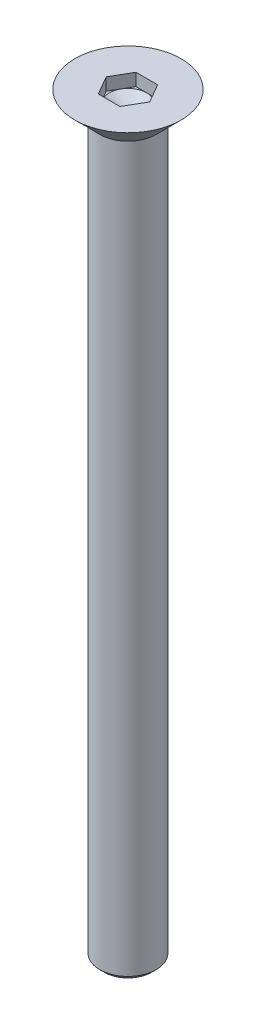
ISO-10303-21;
HEADER;
FILE_DESCRIPTION(('STEP AP214'),'2;1');
FILE_NAME('part.step','',(''),(''),'','','');
FILE_SCHEMA(('AUTOMOTIVE_DESIGN { 1 0 10303 214 1 1 1 1 }'));
ENDSEC;
DATA;
#1=APPLICATION_CONTEXT('core data for automotive mechanical design processes');
#2=APPLICATION_PROTOCOL_DEFINITION('international standard','automotive_design',2000,#1);
#3=PRODUCT_CONTEXT('',#1,'mechanical');
#4=PRODUCT('Part','Part','',(#3));
#5=PRODUCT_RELATED_PRODUCT_CATEGORY('part','',(#4));
#6=PRODUCT_DEFINITION_FORMATION('','',#4);
#7=PRODUCT_DEFINITION_CONTEXT('part definition',#1,'design');
#8=PRODUCT_DEFINITION('design','',#6,#7);
#9=PRODUCT_DEFINITION_SHAPE('','',#8);
#10=(LENGTH_UNIT() NAMED_UNIT(*) SI_UNIT(.MILLI.,.METRE.));
#11=(NAMED_UNIT(*) PLANE_ANGLE_UNIT() SI_UNIT($,.RADIAN.));
#12=(NAMED_UNIT(*) SI_UNIT($,.STERADIAN.) SOLID_ANGLE_UNIT());
#13=UNCERTAINTY_MEASURE_WITH_UNIT(LENGTH_MEASURE(1.E-05),#10,'distance_accuracy_value','');
#14=(GEOMETRIC_REPRESENTATION_CONTEXT(3) GLOBAL_UNCERTAINTY_ASSIGNED_CONTEXT((#13)) GLOBAL_UNIT_ASSIGNED_CONTEXT((#10,
#11,#12)) REPRESENTATION_CONTEXT('',''));
#15=CARTESIAN_POINT('',(0.,0.,0.));
#16=DIRECTION('',(0.,0.,1.));
#17=DIRECTION('',(1.,0.,0.));
#18=AXIS2_PLACEMENT_3D('',#15,#16,#17);
#19=CARTESIAN_POINT('',(0.,0.,0.));
#20=DIRECTION('',(0.,1.,0.));
#21=DIRECTION('',(0.,0.,1.));
#22=AXIS2_PLACEMENT_3D('',#19,#20,#21);
#23=PLANE('',#22);
#24=DIRECTION('',(-0.500000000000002,0.,0.866025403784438));
#25=VECTOR('',#24,1.);
#26=CARTESIAN_POINT('',(-1.15470053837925,0.,-2.));
#27=LINE('',#26,#25);
#28=CARTESIAN_POINT('',(-1.15470053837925,0.,-2.));
#29=VERTEX_POINT('',#28);
#30=CARTESIAN_POINT('',(-2.30940107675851,0.,0.));
#31=VERTEX_POINT('',#30);
#32=EDGE_CURVE('E156',#29,#31,#27,.T.);
#33=ORIENTED_EDGE('',*,*,#32,.F.);
#34=DIRECTION('',(-1.,0.,0.));
#35=VECTOR('',#34,1.);
#36=CARTESIAN_POINT('',(1.15470053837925,0.,-2.));
#37=LINE('',#36,#35);
#38=CARTESIAN_POINT('',(1.15470053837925,0.,-2.));
#39=VERTEX_POINT('',#38);
#40=EDGE_CURVE('E154',#39,#29,#37,.T.);
#41=ORIENTED_EDGE('',*,*,#40,.F.);
#42=DIRECTION('',(-0.500000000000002,0.,-0.866025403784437));
#43=VECTOR('',#42,1.);
#44=CARTESIAN_POINT('',(1.15470053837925,0.,-2.));
#45=LINE('',#44,#43);
#46=CARTESIAN_POINT('',(2.30940107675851,0.,0.));
#47=VERTEX_POINT('',#46);
#48=EDGE_CURVE('E152',#47,#39,#45,.T.);
#49=ORIENTED_EDGE('',*,*,#48,.F.);
#50=DIRECTION('',(0.500000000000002,0.,-0.866025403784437));
#51=VECTOR('',#50,1.);
#52=CARTESIAN_POINT('',(1.15470053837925,0.,2.));
#53=LINE('',#52,#51);
#54=CARTESIAN_POINT('',(1.15470053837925,0.,2.));
#55=VERTEX_POINT('',#54);
#56=EDGE_CURVE('E150',#55,#47,#53,.T.);
#57=ORIENTED_EDGE('',*,*,#56,.F.);
#58=DIRECTION('',(1.,0.,0.));
#59=VECTOR('',#58,1.);
#60=CARTESIAN_POINT('',(1.15470053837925,0.,2.));
#61=LINE('',#60,#59);
#62=CARTESIAN_POINT('',(-1.15470053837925,0.,2.));
#63=VERTEX_POINT('',#62);
#64=EDGE_CURVE('E122',#63,#55,#61,.T.);
#65=ORIENTED_EDGE('',*,*,#64,.F.);
#66=DIRECTION('',(0.500000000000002,0.,0.866025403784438));
#67=VECTOR('',#66,1.);
#68=CARTESIAN_POINT('',(-1.15470053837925,0.,2.));
#69=LINE('',#68,#67);
#70=EDGE_CURVE('E116',#31,#63,#69,.T.);
#71=ORIENTED_EDGE('',*,*,#70,.F.);
#72=EDGE_LOOP('',(#33,#41,#49,#57,#65,#71));
#73=FACE_BOUND('',#72,.T.);
#74=CARTESIAN_POINT('',(0.,0.,0.));
#75=DIRECTION('',(0.,1.,0.));
#76=DIRECTION('',(-1.,0.,0.));
#77=AXIS2_PLACEMENT_3D('',#74,#75,#76);
#78=CIRCLE('',#77,5.65);
#79=CARTESIAN_POINT('',(-5.65,0.,0.));
#80=VERTEX_POINT('',#79);
#81=EDGE_CURVE('E179',#80,#80,#78,.T.);
#82=ORIENTED_EDGE('',*,*,#81,.T.);
#83=EDGE_LOOP('',(#82));
#84=FACE_BOUND('',#83,.T.);
#85=ADVANCED_FACE('F36',(#73,#84),#23,.T.);
#86=CARTESIAN_POINT('',(0.,-80.,0.));
#87=DIRECTION('',(0.,1.,0.));
#88=DIRECTION('',(0.,0.,1.));
#89=AXIS2_PLACEMENT_3D('',#86,#87,#88);
#90=CYLINDRICAL_SURFACE('',#89,3.);
#91=CARTESIAN_POINT('',(0.,-79.5,0.));
#92=DIRECTION('',(0.,1.,0.));
#93=DIRECTION('',(0.,0.,1.));
#94=AXIS2_PLACEMENT_3D('',#91,#92,#93);
#95=CIRCLE('',#94,3.);
#96=CARTESIAN_POINT('',(0.,-79.5,3.));
#97=VERTEX_POINT('',#96);
#98=EDGE_CURVE('E44',#97,#97,#95,.T.);
#99=ORIENTED_EDGE('',*,*,#98,.T.);
#100=EDGE_LOOP('',(#99));
#101=FACE_BOUND('',#100,.T.);
#102=CARTESIAN_POINT('',(0.,-2.64999999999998,0.));
#103=DIRECTION('',(0.,1.,0.));
#104=DIRECTION('',(-1.,0.,0.));
#105=AXIS2_PLACEMENT_3D('',#102,#103,#104);
#106=CIRCLE('',#105,3.);
#107=CARTESIAN_POINT('',(-3.,-2.64999999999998,0.));
#108=VERTEX_POINT('',#107);
#109=EDGE_CURVE('E175',#108,#108,#106,.T.);
#110=ORIENTED_EDGE('',*,*,#109,.F.);
#111=EDGE_LOOP('',(#110));
#112=FACE_BOUND('',#111,.T.);
#113=ADVANCED_FACE('F184',(#101,#112),#90,.T.);
#114=CARTESIAN_POINT('',(0.,-80.,0.));
#115=DIRECTION('',(0.,1.,0.));
#116=DIRECTION('',(0.,0.,1.));
#117=AXIS2_PLACEMENT_3D('',#114,#115,#116);
#118=PLANE('',#117);
#119=CARTESIAN_POINT('',(0.,-80.,0.));
#120=DIRECTION('',(0.,1.,0.));
#121=DIRECTION('',(0.,0.,1.));
#122=AXIS2_PLACEMENT_3D('',#119,#120,#121);
#123=CIRCLE('',#122,2.5);
#124=CARTESIAN_POINT('',(0.,-80.,2.5));
#125=VERTEX_POINT('',#124);
#126=EDGE_CURVE('E11',#125,#125,#123,.F.);
#127=ORIENTED_EDGE('',*,*,#126,.T.);
#128=EDGE_LOOP('',(#127));
#129=FACE_BOUND('',#128,.T.);
#130=ADVANCED_FACE('F189',(#129),#118,.F.);
#131=CARTESIAN_POINT('',(0.,-79.5,0.));
#132=DIRECTION('',(0.,1.,0.));
#133=DIRECTION('',(0.,0.,1.));
#134=AXIS2_PLACEMENT_3D('',#131,#132,#133);
#135=CONICAL_SURFACE('',#134,3.,0.785398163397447);
#136=ORIENTED_EDGE('',*,*,#126,.F.);
#137=EDGE_LOOP('',(#136));
#138=FACE_BOUND('',#137,.T.);
#139=ORIENTED_EDGE('',*,*,#98,.F.);
#140=EDGE_LOOP('',(#139));
#141=FACE_BOUND('',#140,.T.);
#142=ADVANCED_FACE('F38',(#138,#141),#135,.T.);
#143=CARTESIAN_POINT('',(0.,-2.64999999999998,0.));
#144=DIRECTION('',(0.,1.,0.));
#145=DIRECTION('',(-1.,0.,0.));
#146=AXIS2_PLACEMENT_3D('',#143,#144,#145);
#147=CONICAL_SURFACE('',#146,3.,0.785398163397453);
#148=ORIENTED_EDGE('',*,*,#81,.F.);
#149=EDGE_LOOP('',(#148));
#150=FACE_BOUND('',#149,.T.);
#151=ORIENTED_EDGE('',*,*,#109,.T.);
#152=EDGE_LOOP('',(#151));
#153=FACE_BOUND('',#152,.T.);
#154=ADVANCED_FACE('F188',(#150,#153),#147,.T.);
#155=CARTESIAN_POINT('',(1.15470053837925,-1.325,2.));
#156=DIRECTION('',(0.,0.,1.));
#157=DIRECTION('',(1.,0.,0.));
#158=AXIS2_PLACEMENT_3D('',#155,#156,#157);
#159=PLANE('',#158);
#160=DIRECTION('',(1.,0.,0.));
#161=VECTOR('',#160,1.);
#162=CARTESIAN_POINT('',(1.15470053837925,-1.325,2.));
#163=LINE('',#162,#161);
#164=CARTESIAN_POINT('',(-1.15470053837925,-1.325,2.));
#165=VERTEX_POINT('',#164);
#166=CARTESIAN_POINT('',(0.,-1.325,2.));
#167=VERTEX_POINT('',#166);
#168=EDGE_CURVE('E51',#165,#167,#163,.T.);
#169=ORIENTED_EDGE('',*,*,#168,.F.);
#170=DIRECTION('',(0.,1.,0.));
#171=VECTOR('',#170,1.);
#172=CARTESIAN_POINT('',(-1.15470053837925,-1.325,2.));
#173=LINE('',#172,#171);
#174=EDGE_CURVE('E160',#165,#63,#173,.T.);
#175=ORIENTED_EDGE('',*,*,#174,.T.);
#176=ORIENTED_EDGE('',*,*,#64,.T.);
#177=DIRECTION('',(0.,1.,0.));
#178=VECTOR('',#177,1.);
#179=CARTESIAN_POINT('',(1.15470053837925,-1.325,2.));
#180=LINE('',#179,#178);
#181=CARTESIAN_POINT('',(1.15470053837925,-1.325,2.));
#182=VERTEX_POINT('',#181);
#183=EDGE_CURVE('E119',#182,#55,#180,.T.);
#184=ORIENTED_EDGE('',*,*,#183,.F.);
#185=EDGE_CURVE('E107',#167,#182,#163,.T.);
#186=ORIENTED_EDGE('',*,*,#185,.F.);
#187=EDGE_LOOP('',(#169,#175,#176,#184,#186));
#188=FACE_BOUND('',#187,.T.);
#189=ADVANCED_FACE('F120',(#188),#159,.F.);
#190=CARTESIAN_POINT('',(-1.15470053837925,-1.325,2.));
#191=DIRECTION('',(-0.866025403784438,0.,0.500000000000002));
#192=DIRECTION('',(0.500000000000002,0.,0.866025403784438));
#193=AXIS2_PLACEMENT_3D('',#190,#191,#192);
#194=PLANE('',#193);
#195=DIRECTION('',(0.500000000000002,0.,0.866025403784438));
#196=VECTOR('',#195,1.);
#197=CARTESIAN_POINT('',(-1.15470053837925,-1.325,2.));
#198=LINE('',#197,#196);
#199=CARTESIAN_POINT('',(-2.30940107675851,-1.325,0.));
#200=VERTEX_POINT('',#199);
#201=CARTESIAN_POINT('',(-1.73205080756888,-1.325,1.00000000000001));
#202=VERTEX_POINT('',#201);
#203=EDGE_CURVE('E126',#200,#202,#198,.T.);
#204=ORIENTED_EDGE('',*,*,#203,.F.);
#205=DIRECTION('',(0.,1.,0.));
#206=VECTOR('',#205,1.);
#207=CARTESIAN_POINT('',(-2.30940107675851,-1.325,0.));
#208=LINE('',#207,#206);
#209=EDGE_CURVE('E163',#200,#31,#208,.T.);
#210=ORIENTED_EDGE('',*,*,#209,.T.);
#211=ORIENTED_EDGE('',*,*,#70,.T.);
#212=ORIENTED_EDGE('',*,*,#174,.F.);
#213=EDGE_CURVE('E146',#202,#165,#198,.T.);
#214=ORIENTED_EDGE('',*,*,#213,.F.);
#215=EDGE_LOOP('',(#204,#210,#211,#212,#214));
#216=FACE_BOUND('',#215,.T.);
#217=ADVANCED_FACE('F216',(#216),#194,.F.);
#218=CARTESIAN_POINT('',(-1.15470053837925,-1.325,-2.));
#219=DIRECTION('',(-0.866025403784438,0.,-0.500000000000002));
#220=DIRECTION('',(-0.500000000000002,0.,0.866025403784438));
#221=AXIS2_PLACEMENT_3D('',#218,#219,#220);
#222=PLANE('',#221);
#223=DIRECTION('',(-0.500000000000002,0.,0.866025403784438));
#224=VECTOR('',#223,1.);
#225=CARTESIAN_POINT('',(-1.15470053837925,-1.325,-2.));
#226=LINE('',#225,#224);
#227=CARTESIAN_POINT('',(-1.15470053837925,-1.325,-2.));
#228=VERTEX_POINT('',#227);
#229=CARTESIAN_POINT('',(-1.73205080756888,-1.325,-1.00000000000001));
#230=VERTEX_POINT('',#229);
#231=EDGE_CURVE('E143',#228,#230,#226,.T.);
#232=ORIENTED_EDGE('',*,*,#231,.F.);
#233=DIRECTION('',(0.,1.,0.));
#234=VECTOR('',#233,1.);
#235=CARTESIAN_POINT('',(-1.15470053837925,-1.325,-2.));
#236=LINE('',#235,#234);
#237=EDGE_CURVE('E166',#228,#29,#236,.T.);
#238=ORIENTED_EDGE('',*,*,#237,.T.);
#239=ORIENTED_EDGE('',*,*,#32,.T.);
#240=ORIENTED_EDGE('',*,*,#209,.F.);
#241=EDGE_CURVE('E142',#230,#200,#226,.T.);
#242=ORIENTED_EDGE('',*,*,#241,.F.);
#243=EDGE_LOOP('',(#232,#238,#239,#240,#242));
#244=FACE_BOUND('',#243,.T.);
#245=ADVANCED_FACE('F226',(#244),#222,.F.);
#246=CARTESIAN_POINT('',(1.15470053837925,-1.325,-2.));
#247=DIRECTION('',(0.,0.,-1.));
#248=DIRECTION('',(-1.,0.,0.));
#249=AXIS2_PLACEMENT_3D('',#246,#247,#248);
#250=PLANE('',#249);
#251=DIRECTION('',(-1.,0.,0.));
#252=VECTOR('',#251,1.);
#253=CARTESIAN_POINT('',(1.15470053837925,-1.325,-2.));
#254=LINE('',#253,#252);
#255=CARTESIAN_POINT('',(1.15470053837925,-1.325,-2.));
#256=VERTEX_POINT('',#255);
#257=CARTESIAN_POINT('',(0.,-1.325,-2.));
#258=VERTEX_POINT('',#257);
#259=EDGE_CURVE('E139',#256,#258,#254,.T.);
#260=ORIENTED_EDGE('',*,*,#259,.F.);
#261=DIRECTION('',(0.,1.,0.));
#262=VECTOR('',#261,1.);
#263=CARTESIAN_POINT('',(1.15470053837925,-1.325,-2.));
#264=LINE('',#263,#262);
#265=EDGE_CURVE('E169',#256,#39,#264,.T.);
#266=ORIENTED_EDGE('',*,*,#265,.T.);
#267=ORIENTED_EDGE('',*,*,#40,.T.);
#268=ORIENTED_EDGE('',*,*,#237,.F.);
#269=EDGE_CURVE('E138',#258,#228,#254,.T.);
#270=ORIENTED_EDGE('',*,*,#269,.F.);
#271=EDGE_LOOP('',(#260,#266,#267,#268,#270));
#272=FACE_BOUND('',#271,.T.);
#273=ADVANCED_FACE('F222',(#272),#250,.F.);
#274=CARTESIAN_POINT('',(1.15470053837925,-1.325,-2.));
#275=DIRECTION('',(0.866025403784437,0.,-0.500000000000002));
#276=DIRECTION('',(-0.500000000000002,0.,-0.866025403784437));
#277=AXIS2_PLACEMENT_3D('',#274,#275,#276);
#278=PLANE('',#277);
#279=DIRECTION('',(-0.500000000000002,0.,-0.866025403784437));
#280=VECTOR('',#279,1.);
#281=CARTESIAN_POINT('',(1.15470053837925,-1.325,-2.));
#282=LINE('',#281,#280);
#283=CARTESIAN_POINT('',(2.30940107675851,-1.325,0.));
#284=VERTEX_POINT('',#283);
#285=CARTESIAN_POINT('',(1.73205080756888,-1.325,-1.00000000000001));
#286=VERTEX_POINT('',#285);
#287=EDGE_CURVE('E134',#284,#286,#282,.T.);
#288=ORIENTED_EDGE('',*,*,#287,.F.);
#289=DIRECTION('',(0.,1.,0.));
#290=VECTOR('',#289,1.);
#291=CARTESIAN_POINT('',(2.30940107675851,-1.325,0.));
#292=LINE('',#291,#290);
#293=EDGE_CURVE('E125',#284,#47,#292,.T.);
#294=ORIENTED_EDGE('',*,*,#293,.T.);
#295=ORIENTED_EDGE('',*,*,#48,.T.);
#296=ORIENTED_EDGE('',*,*,#265,.F.);
#297=EDGE_CURVE('E132',#286,#256,#282,.T.);
#298=ORIENTED_EDGE('',*,*,#297,.F.);
#299=EDGE_LOOP('',(#288,#294,#295,#296,#298));
#300=FACE_BOUND('',#299,.T.);
#301=ADVANCED_FACE('F219',(#300),#278,.F.);
#302=CARTESIAN_POINT('',(1.15470053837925,-1.325,2.));
#303=DIRECTION('',(0.866025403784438,0.,0.500000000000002));
#304=DIRECTION('',(0.500000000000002,0.,-0.866025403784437));
#305=AXIS2_PLACEMENT_3D('',#302,#303,#304);
#306=PLANE('',#305);
#307=DIRECTION('',(0.500000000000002,0.,-0.866025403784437));
#308=VECTOR('',#307,1.);
#309=CARTESIAN_POINT('',(1.15470053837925,-1.325,2.));
#310=LINE('',#309,#308);
#311=CARTESIAN_POINT('',(1.73205080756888,-1.325,1.00000000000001));
#312=VERTEX_POINT('',#311);
#313=EDGE_CURVE('E111',#182,#312,#310,.T.);
#314=ORIENTED_EDGE('',*,*,#313,.F.);
#315=ORIENTED_EDGE('',*,*,#183,.T.);
#316=ORIENTED_EDGE('',*,*,#56,.T.);
#317=ORIENTED_EDGE('',*,*,#293,.F.);
#318=EDGE_CURVE('E131',#312,#284,#310,.T.);
#319=ORIENTED_EDGE('',*,*,#318,.F.);
#320=EDGE_LOOP('',(#314,#315,#316,#317,#319));
#321=FACE_BOUND('',#320,.T.);
#322=ADVANCED_FACE('F129',(#321),#306,.F.);
#323=CARTESIAN_POINT('',(-3.46410161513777,-1.325,2.));
#324=DIRECTION('',(0.,1.,0.));
#325=DIRECTION('',(0.,0.,1.));
#326=AXIS2_PLACEMENT_3D('',#323,#324,#325);
#327=PLANE('',#326);
#328=ORIENTED_EDGE('',*,*,#185,.T.);
#329=ORIENTED_EDGE('',*,*,#313,.T.);
#330=CARTESIAN_POINT('',(0.,-1.325,0.));
#331=DIRECTION('',(0.,1.,0.));
#332=DIRECTION('',(0.,0.,1.));
#333=AXIS2_PLACEMENT_3D('',#330,#331,#332);
#334=CIRCLE('',#333,2.);
#335=EDGE_CURVE('E113',#167,#312,#334,.T.);
#336=ORIENTED_EDGE('',*,*,#335,.F.);
#337=EDGE_LOOP('',(#328,#329,#336));
#338=FACE_BOUND('',#337,.T.);
#339=ADVANCED_FACE('F109',(#338),#327,.T.);
#340=ORIENTED_EDGE('',*,*,#318,.T.);
#341=ORIENTED_EDGE('',*,*,#287,.T.);
#342=EDGE_CURVE('E176',#312,#286,#334,.T.);
#343=ORIENTED_EDGE('',*,*,#342,.F.);
#344=EDGE_LOOP('',(#340,#341,#343));
#345=FACE_BOUND('',#344,.T.);
#346=ADVANCED_FACE('F242',(#345),#327,.T.);
#347=ORIENTED_EDGE('',*,*,#297,.T.);
#348=ORIENTED_EDGE('',*,*,#259,.T.);
#349=EDGE_CURVE('E259',#286,#258,#334,.T.);
#350=ORIENTED_EDGE('',*,*,#349,.F.);
#351=EDGE_LOOP('',(#347,#348,#350));
#352=FACE_BOUND('',#351,.T.);
#353=ADVANCED_FACE('F246',(#352),#327,.T.);
#354=ORIENTED_EDGE('',*,*,#269,.T.);
#355=ORIENTED_EDGE('',*,*,#231,.T.);
#356=EDGE_CURVE('E261',#258,#230,#334,.T.);
#357=ORIENTED_EDGE('',*,*,#356,.F.);
#358=EDGE_LOOP('',(#354,#355,#357));
#359=FACE_BOUND('',#358,.T.);
#360=ADVANCED_FACE('F239',(#359),#327,.T.);
#361=ORIENTED_EDGE('',*,*,#241,.T.);
#362=ORIENTED_EDGE('',*,*,#203,.T.);
#363=EDGE_CURVE('E262',#230,#202,#334,.T.);
#364=ORIENTED_EDGE('',*,*,#363,.F.);
#365=EDGE_LOOP('',(#361,#362,#364));
#366=FACE_BOUND('',#365,.T.);
#367=ADVANCED_FACE('F235',(#366),#327,.T.);
#368=ORIENTED_EDGE('',*,*,#213,.T.);
#369=ORIENTED_EDGE('',*,*,#168,.T.);
#370=EDGE_CURVE('E162',#202,#167,#334,.T.);
#371=ORIENTED_EDGE('',*,*,#370,.F.);
#372=EDGE_LOOP('',(#368,#369,#371));
#373=FACE_BOUND('',#372,.T.);
#374=ADVANCED_FACE('F212',(#373),#327,.T.);
#375=CARTESIAN_POINT('',(0.,-2.47970053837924,0.));
#376=DIRECTION('',(0.,1.,0.));
#377=DIRECTION('',(0.,0.,1.));
#378=AXIS2_PLACEMENT_3D('',#375,#376,#377);
#379=CONICAL_SURFACE('',#378,0.,1.0471975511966);
#380=ORIENTED_EDGE('',*,*,#335,.T.);
#381=ORIENTED_EDGE('',*,*,#342,.T.);
#382=ORIENTED_EDGE('',*,*,#349,.T.);
#383=ORIENTED_EDGE('',*,*,#356,.T.);
#384=ORIENTED_EDGE('',*,*,#363,.T.);
#385=ORIENTED_EDGE('',*,*,#370,.T.);
#386=EDGE_LOOP('',(#380,#381,#382,#383,#384,#385));
#387=FACE_BOUND('',#386,.T.);
#388=CARTESIAN_POINT('',(0.,-2.47970053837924,0.));
#389=VERTEX_POINT('',#388);
#390=VERTEX_LOOP('',#389);
#391=FACE_BOUND('',#390,.T.);
#392=ADVANCED_FACE('F209',(#387,#391),#379,.F.);
#393=CLOSED_SHELL('',(#85,#113,#130,#142,#154,#189,#217,#245,#273,#301,#322,#339,#346,#353,#360,
#367,#374,#392));
#394=MANIFOLD_SOLID_BREP('B2',#393);
#395=ADVANCED_BREP_SHAPE_REPRESENTATION('',(#18,#394),#14);
#396=SHAPE_DEFINITION_REPRESENTATION(#9,#395);
ENDSEC;
END-ISO-10303-21;
